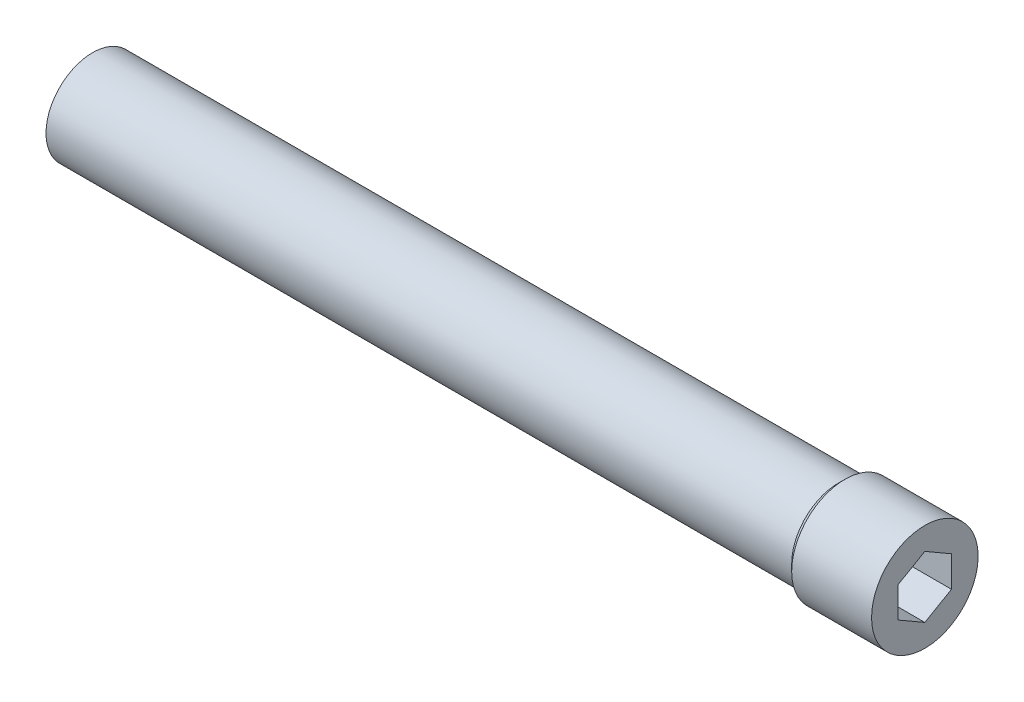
ISO-10303-21;
HEADER;
FILE_DESCRIPTION(('STEP AP214'),'2;1');
FILE_NAME('part.step','',(''),(''),'','','');
FILE_SCHEMA(('AUTOMOTIVE_DESIGN { 1 0 10303 214 1 1 1 1 }'));
ENDSEC;
DATA;
#1=APPLICATION_CONTEXT('core data for automotive mechanical design processes');
#2=APPLICATION_PROTOCOL_DEFINITION('international standard','automotive_design',2000,#1);
#3=PRODUCT_CONTEXT('',#1,'mechanical');
#4=PRODUCT('Part','Part','',(#3));
#5=PRODUCT_RELATED_PRODUCT_CATEGORY('part','',(#4));
#6=PRODUCT_DEFINITION_FORMATION('','',#4);
#7=PRODUCT_DEFINITION_CONTEXT('part definition',#1,'design');
#8=PRODUCT_DEFINITION('design','',#6,#7);
#9=PRODUCT_DEFINITION_SHAPE('','',#8);
#10=(LENGTH_UNIT() NAMED_UNIT(*) SI_UNIT(.MILLI.,.METRE.));
#11=(NAMED_UNIT(*) PLANE_ANGLE_UNIT() SI_UNIT($,.RADIAN.));
#12=(NAMED_UNIT(*) SI_UNIT($,.STERADIAN.) SOLID_ANGLE_UNIT());
#13=UNCERTAINTY_MEASURE_WITH_UNIT(LENGTH_MEASURE(1.E-05),#10,'distance_accuracy_value','');
#14=(GEOMETRIC_REPRESENTATION_CONTEXT(3) GLOBAL_UNCERTAINTY_ASSIGNED_CONTEXT((#13)) GLOBAL_UNIT_ASSIGNED_CONTEXT((#10,
#11,#12)) REPRESENTATION_CONTEXT('',''));
#15=CARTESIAN_POINT('',(0.,0.,0.));
#16=DIRECTION('',(0.,0.,1.));
#17=DIRECTION('',(1.,0.,0.));
#18=AXIS2_PLACEMENT_3D('',#15,#16,#17);
#19=CARTESIAN_POINT('',(0.,0.,0.));
#20=DIRECTION('',(1.,0.,0.));
#21=DIRECTION('',(0.,0.,-1.));
#22=AXIS2_PLACEMENT_3D('',#19,#20,#21);
#23=PLANE('',#22);
#24=CARTESIAN_POINT('',(0.,0.,0.));
#25=DIRECTION('',(-1.,0.,0.));
#26=DIRECTION('',(0.,0.,1.));
#27=AXIS2_PLACEMENT_3D('',#24,#25,#26);
#28=CIRCLE('',#27,7.);
#29=CARTESIAN_POINT('',(0.,0.,7.));
#30=VERTEX_POINT('',#29);
#31=EDGE_CURVE('E10',#30,#30,#28,.T.);
#32=ORIENTED_EDGE('',*,*,#31,.T.);
#33=EDGE_LOOP('',(#32));
#34=FACE_BOUND('',#33,.T.);
#35=ADVANCED_FACE('F16',(#34),#23,.F.);
#36=CARTESIAN_POINT('',(0.,0.,0.));
#37=DIRECTION('',(-1.,0.,0.));
#38=DIRECTION('',(0.,0.,1.));
#39=AXIS2_PLACEMENT_3D('',#36,#37,#38);
#40=CYLINDRICAL_SURFACE('',#39,7.);
#41=ORIENTED_EDGE('',*,*,#31,.F.);
#42=EDGE_LOOP('',(#41));
#43=FACE_BOUND('',#42,.T.);
#44=CARTESIAN_POINT('',(112.,0.,0.));
#45=DIRECTION('',(-1.,0.,0.));
#46=DIRECTION('',(0.,0.,1.));
#47=AXIS2_PLACEMENT_3D('',#44,#45,#46);
#48=CIRCLE('',#47,7.);
#49=CARTESIAN_POINT('',(112.,0.,7.));
#50=VERTEX_POINT('',#49);
#51=EDGE_CURVE('E23',#50,#50,#48,.T.);
#52=ORIENTED_EDGE('',*,*,#51,.T.);
#53=EDGE_LOOP('',(#52));
#54=FACE_BOUND('',#53,.T.);
#55=ADVANCED_FACE('F130',(#43,#54),#40,.T.);
#56=CARTESIAN_POINT('',(113.,0.,0.));
#57=DIRECTION('',(1.,0.,0.));
#58=DIRECTION('',(0.,0.,-1.));
#59=AXIS2_PLACEMENT_3D('',#56,#57,#58);
#60=CONICAL_SURFACE('',#59,8.,0.785398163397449);
#61=ORIENTED_EDGE('',*,*,#51,.F.);
#62=EDGE_LOOP('',(#61));
#63=FACE_BOUND('',#62,.T.);
#64=CARTESIAN_POINT('',(113.,0.,0.));
#65=DIRECTION('',(-1.,0.,0.));
#66=DIRECTION('',(0.,0.,1.));
#67=AXIS2_PLACEMENT_3D('',#64,#65,#66);
#68=CIRCLE('',#67,8.);
#69=CARTESIAN_POINT('',(113.,0.,8.));
#70=VERTEX_POINT('',#69);
#71=EDGE_CURVE('E125',#70,#70,#68,.T.);
#72=ORIENTED_EDGE('',*,*,#71,.T.);
#73=EDGE_LOOP('',(#72));
#74=FACE_BOUND('',#73,.T.);
#75=ADVANCED_FACE('F132',(#63,#74),#60,.T.);
#76=CARTESIAN_POINT('',(0.,0.,0.));
#77=DIRECTION('',(-1.,0.,0.));
#78=DIRECTION('',(0.,0.,1.));
#79=AXIS2_PLACEMENT_3D('',#76,#77,#78);
#80=CYLINDRICAL_SURFACE('',#79,8.);
#81=ORIENTED_EDGE('',*,*,#71,.F.);
#82=EDGE_LOOP('',(#81));
#83=FACE_BOUND('',#82,.T.);
#84=CARTESIAN_POINT('',(125.,0.,0.));
#85=DIRECTION('',(-1.,0.,0.));
#86=DIRECTION('',(0.,0.,1.));
#87=AXIS2_PLACEMENT_3D('',#84,#85,#86);
#88=CIRCLE('',#87,8.);
#89=CARTESIAN_POINT('',(125.,0.,8.));
#90=VERTEX_POINT('',#89);
#91=EDGE_CURVE('E117',#90,#90,#88,.T.);
#92=ORIENTED_EDGE('',*,*,#91,.T.);
#93=EDGE_LOOP('',(#92));
#94=FACE_BOUND('',#93,.T.);
#95=ADVANCED_FACE('F135',(#83,#94),#80,.T.);
#96=CARTESIAN_POINT('',(125.,8.,0.));
#97=DIRECTION('',(-1.,0.,0.));
#98=DIRECTION('',(0.,0.,1.));
#99=AXIS2_PLACEMENT_3D('',#96,#97,#98);
#100=PLANE('',#99);
#101=DIRECTION('',(0.,-0.5,0.866025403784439));
#102=VECTOR('',#101,1.);
#103=CARTESIAN_POINT('',(125.,4.61880215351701,0.));
#104=LINE('',#103,#102);
#105=CARTESIAN_POINT('',(125.,4.61880215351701,0.));
#106=VERTEX_POINT('',#105);
#107=CARTESIAN_POINT('',(125.,2.30940107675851,4.));
#108=VERTEX_POINT('',#107);
#109=EDGE_CURVE('E104',#106,#108,#104,.T.);
#110=ORIENTED_EDGE('',*,*,#109,.F.);
#111=DIRECTION('',(0.,0.5,0.866025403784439));
#112=VECTOR('',#111,1.);
#113=CARTESIAN_POINT('',(125.,2.30940107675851,-4.));
#114=LINE('',#113,#112);
#115=CARTESIAN_POINT('',(125.,2.30940107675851,-4.));
#116=VERTEX_POINT('',#115);
#117=EDGE_CURVE('E30',#116,#106,#114,.T.);
#118=ORIENTED_EDGE('',*,*,#117,.F.);
#119=DIRECTION('',(0.,1.,0.));
#120=VECTOR('',#119,1.);
#121=CARTESIAN_POINT('',(125.,-2.30940107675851,-4.));
#122=LINE('',#121,#120);
#123=CARTESIAN_POINT('',(125.,-2.30940107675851,-4.));
#124=VERTEX_POINT('',#123);
#125=EDGE_CURVE('E113',#124,#116,#122,.T.);
#126=ORIENTED_EDGE('',*,*,#125,.F.);
#127=DIRECTION('',(0.,0.5,-0.866025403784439));
#128=VECTOR('',#127,1.);
#129=CARTESIAN_POINT('',(125.,-4.61880215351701,0.));
#130=LINE('',#129,#128);
#131=CARTESIAN_POINT('',(125.,-4.61880215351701,0.));
#132=VERTEX_POINT('',#131);
#133=EDGE_CURVE('E111',#132,#124,#130,.T.);
#134=ORIENTED_EDGE('',*,*,#133,.F.);
#135=DIRECTION('',(0.,-0.5,-0.866025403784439));
#136=VECTOR('',#135,1.);
#137=CARTESIAN_POINT('',(125.,-2.30940107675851,4.));
#138=LINE('',#137,#136);
#139=CARTESIAN_POINT('',(125.,-2.30940107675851,4.));
#140=VERTEX_POINT('',#139);
#141=EDGE_CURVE('E78',#140,#132,#138,.T.);
#142=ORIENTED_EDGE('',*,*,#141,.F.);
#143=DIRECTION('',(0.,-1.,0.));
#144=VECTOR('',#143,1.);
#145=CARTESIAN_POINT('',(125.,2.30940107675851,4.));
#146=LINE('',#145,#144);
#147=EDGE_CURVE('E107',#108,#140,#146,.T.);
#148=ORIENTED_EDGE('',*,*,#147,.F.);
#149=EDGE_LOOP('',(#110,#118,#126,#134,#142,#148));
#150=FACE_BOUND('',#149,.T.);
#151=ORIENTED_EDGE('',*,*,#91,.F.);
#152=EDGE_LOOP('',(#151));
#153=FACE_BOUND('',#152,.T.);
#154=ADVANCED_FACE('F141',(#150,#153),#100,.F.);
#155=CARTESIAN_POINT('',(115.,2.30940107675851,-4.));
#156=DIRECTION('',(0.,0.866025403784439,-0.5));
#157=DIRECTION('',(0.,0.5,0.866025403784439));
#158=AXIS2_PLACEMENT_3D('',#155,#156,#157);
#159=PLANE('',#158);
#160=ORIENTED_EDGE('',*,*,#117,.T.);
#161=DIRECTION('',(1.,0.,0.));
#162=VECTOR('',#161,1.);
#163=CARTESIAN_POINT('',(115.,4.61880215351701,0.));
#164=LINE('',#163,#162);
#165=CARTESIAN_POINT('',(115.,4.61880215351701,0.));
#166=VERTEX_POINT('',#165);
#167=EDGE_CURVE('E60',#166,#106,#164,.T.);
#168=ORIENTED_EDGE('',*,*,#167,.F.);
#169=DIRECTION('',(0.,0.5,0.866025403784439));
#170=VECTOR('',#169,1.);
#171=CARTESIAN_POINT('',(115.,2.30940107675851,-4.));
#172=LINE('',#171,#170);
#173=CARTESIAN_POINT('',(115.,2.30940107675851,-4.));
#174=VERTEX_POINT('',#173);
#175=EDGE_CURVE('E115',#174,#166,#172,.T.);
#176=ORIENTED_EDGE('',*,*,#175,.F.);
#177=DIRECTION('',(1.,0.,0.));
#178=VECTOR('',#177,1.);
#179=CARTESIAN_POINT('',(115.,2.30940107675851,-4.));
#180=LINE('',#179,#178);
#181=EDGE_CURVE('E38',#174,#116,#180,.T.);
#182=ORIENTED_EDGE('',*,*,#181,.T.);
#183=EDGE_LOOP('',(#160,#168,#176,#182));
#184=FACE_BOUND('',#183,.T.);
#185=ADVANCED_FACE('F146',(#184),#159,.F.);
#186=CARTESIAN_POINT('',(115.,-2.30940107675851,-4.));
#187=DIRECTION('',(0.,0.,-1.));
#188=DIRECTION('',(-1.,0.,0.));
#189=AXIS2_PLACEMENT_3D('',#186,#187,#188);
#190=PLANE('',#189);
#191=ORIENTED_EDGE('',*,*,#125,.T.);
#192=ORIENTED_EDGE('',*,*,#181,.F.);
#193=DIRECTION('',(0.,1.,0.));
#194=VECTOR('',#193,1.);
#195=CARTESIAN_POINT('',(115.,-2.30940107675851,-4.));
#196=LINE('',#195,#194);
#197=CARTESIAN_POINT('',(115.,-2.30940107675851,-4.));
#198=VERTEX_POINT('',#197);
#199=EDGE_CURVE('E90',#198,#174,#196,.T.);
#200=ORIENTED_EDGE('',*,*,#199,.F.);
#201=DIRECTION('',(1.,0.,0.));
#202=VECTOR('',#201,1.);
#203=CARTESIAN_POINT('',(115.,-2.30940107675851,-4.));
#204=LINE('',#203,#202);
#205=EDGE_CURVE('E82',#198,#124,#204,.T.);
#206=ORIENTED_EDGE('',*,*,#205,.T.);
#207=EDGE_LOOP('',(#191,#192,#200,#206));
#208=FACE_BOUND('',#207,.T.);
#209=ADVANCED_FACE('F154',(#208),#190,.F.);
#210=CARTESIAN_POINT('',(115.,-4.61880215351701,0.));
#211=DIRECTION('',(0.,-0.866025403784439,-0.5));
#212=DIRECTION('',(0.,0.5,-0.866025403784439));
#213=AXIS2_PLACEMENT_3D('',#210,#211,#212);
#214=PLANE('',#213);
#215=ORIENTED_EDGE('',*,*,#133,.T.);
#216=ORIENTED_EDGE('',*,*,#205,.F.);
#217=DIRECTION('',(0.,0.5,-0.866025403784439));
#218=VECTOR('',#217,1.);
#219=CARTESIAN_POINT('',(115.,-4.61880215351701,0.));
#220=LINE('',#219,#218);
#221=CARTESIAN_POINT('',(115.,-4.61880215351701,0.));
#222=VERTEX_POINT('',#221);
#223=EDGE_CURVE('E86',#222,#198,#220,.T.);
#224=ORIENTED_EDGE('',*,*,#223,.F.);
#225=DIRECTION('',(1.,0.,0.));
#226=VECTOR('',#225,1.);
#227=CARTESIAN_POINT('',(115.,-4.61880215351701,0.));
#228=LINE('',#227,#226);
#229=EDGE_CURVE('E71',#222,#132,#228,.T.);
#230=ORIENTED_EDGE('',*,*,#229,.T.);
#231=EDGE_LOOP('',(#215,#216,#224,#230));
#232=FACE_BOUND('',#231,.T.);
#233=ADVANCED_FACE('F87',(#232),#214,.F.);
#234=CARTESIAN_POINT('',(115.,-2.30940107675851,4.));
#235=DIRECTION('',(0.,-0.866025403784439,0.5));
#236=DIRECTION('',(0.,-0.5,-0.866025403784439));
#237=AXIS2_PLACEMENT_3D('',#234,#235,#236);
#238=PLANE('',#237);
#239=ORIENTED_EDGE('',*,*,#141,.T.);
#240=ORIENTED_EDGE('',*,*,#229,.F.);
#241=DIRECTION('',(0.,-0.5,-0.866025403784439));
#242=VECTOR('',#241,1.);
#243=CARTESIAN_POINT('',(115.,-2.30940107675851,4.));
#244=LINE('',#243,#242);
#245=CARTESIAN_POINT('',(115.,-2.30940107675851,4.));
#246=VERTEX_POINT('',#245);
#247=EDGE_CURVE('E75',#246,#222,#244,.T.);
#248=ORIENTED_EDGE('',*,*,#247,.F.);
#249=DIRECTION('',(1.,0.,0.));
#250=VECTOR('',#249,1.);
#251=CARTESIAN_POINT('',(115.,-2.30940107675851,4.));
#252=LINE('',#251,#250);
#253=EDGE_CURVE('E83',#246,#140,#252,.T.);
#254=ORIENTED_EDGE('',*,*,#253,.T.);
#255=EDGE_LOOP('',(#239,#240,#248,#254));
#256=FACE_BOUND('',#255,.T.);
#257=ADVANCED_FACE('F73',(#256),#238,.F.);
#258=CARTESIAN_POINT('',(115.,2.30940107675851,4.));
#259=DIRECTION('',(0.,0.,1.));
#260=DIRECTION('',(1.,0.,0.));
#261=AXIS2_PLACEMENT_3D('',#258,#259,#260);
#262=PLANE('',#261);
#263=ORIENTED_EDGE('',*,*,#147,.T.);
#264=ORIENTED_EDGE('',*,*,#253,.F.);
#265=DIRECTION('',(0.,-1.,0.));
#266=VECTOR('',#265,1.);
#267=CARTESIAN_POINT('',(115.,2.30940107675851,4.));
#268=LINE('',#267,#266);
#269=CARTESIAN_POINT('',(115.,2.30940107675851,4.));
#270=VERTEX_POINT('',#269);
#271=EDGE_CURVE('E96',#270,#246,#268,.T.);
#272=ORIENTED_EDGE('',*,*,#271,.F.);
#273=DIRECTION('',(1.,0.,0.));
#274=VECTOR('',#273,1.);
#275=CARTESIAN_POINT('',(115.,2.30940107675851,4.));
#276=LINE('',#275,#274);
#277=EDGE_CURVE('E120',#270,#108,#276,.T.);
#278=ORIENTED_EDGE('',*,*,#277,.T.);
#279=EDGE_LOOP('',(#263,#264,#272,#278));
#280=FACE_BOUND('',#279,.T.);
#281=ADVANCED_FACE('F221',(#280),#262,.F.);
#282=CARTESIAN_POINT('',(115.,4.61880215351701,0.));
#283=DIRECTION('',(0.,0.866025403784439,0.5));
#284=DIRECTION('',(0.,-0.5,0.866025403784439));
#285=AXIS2_PLACEMENT_3D('',#282,#283,#284);
#286=PLANE('',#285);
#287=ORIENTED_EDGE('',*,*,#109,.T.);
#288=ORIENTED_EDGE('',*,*,#277,.F.);
#289=DIRECTION('',(0.,-0.5,0.866025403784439));
#290=VECTOR('',#289,1.);
#291=CARTESIAN_POINT('',(115.,4.61880215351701,0.));
#292=LINE('',#291,#290);
#293=EDGE_CURVE('E98',#166,#270,#292,.T.);
#294=ORIENTED_EDGE('',*,*,#293,.F.);
#295=ORIENTED_EDGE('',*,*,#167,.T.);
#296=EDGE_LOOP('',(#287,#288,#294,#295));
#297=FACE_BOUND('',#296,.T.);
#298=ADVANCED_FACE('F229',(#297),#286,.F.);
#299=CARTESIAN_POINT('',(115.,0.,0.));
#300=DIRECTION('',(1.,0.,0.));
#301=DIRECTION('',(0.,0.,-1.));
#302=AXIS2_PLACEMENT_3D('',#299,#300,#301);
#303=PLANE('',#302);
#304=ORIENTED_EDGE('',*,*,#175,.T.);
#305=ORIENTED_EDGE('',*,*,#293,.T.);
#306=ORIENTED_EDGE('',*,*,#271,.T.);
#307=ORIENTED_EDGE('',*,*,#247,.T.);
#308=ORIENTED_EDGE('',*,*,#223,.T.);
#309=ORIENTED_EDGE('',*,*,#199,.T.);
#310=EDGE_LOOP('',(#304,#305,#306,#307,#308,#309));
#311=FACE_BOUND('',#310,.T.);
#312=ADVANCED_FACE('F93',(#311),#303,.T.);
#313=CLOSED_SHELL('',(#35,#55,#75,#95,#154,#185,#209,#233,#257,#281,#298,#312));
#314=MANIFOLD_SOLID_BREP('B1',#313);
#315=ADVANCED_BREP_SHAPE_REPRESENTATION('',(#18,#314),#14);
#316=SHAPE_DEFINITION_REPRESENTATION(#9,#315);
ENDSEC;
END-ISO-10303-21;
